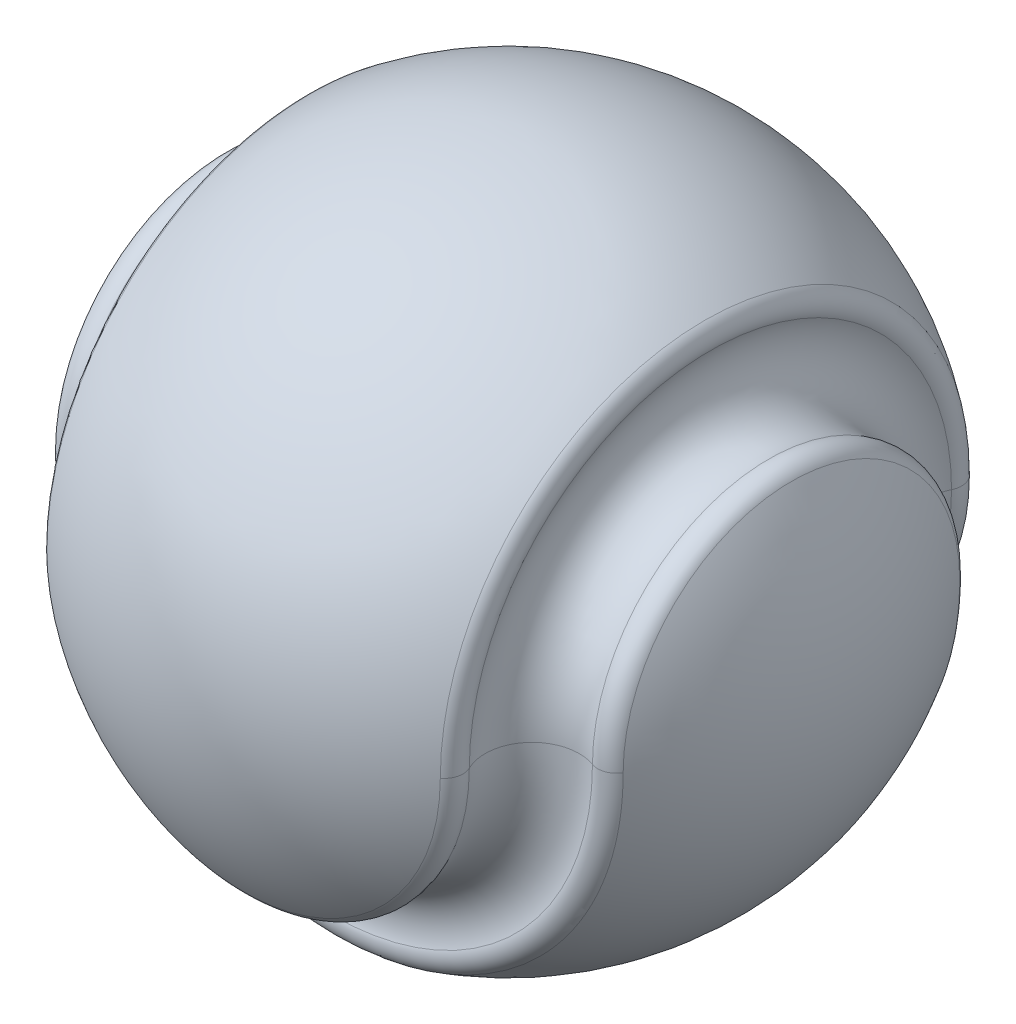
ISO-10303-21;
HEADER;
FILE_DESCRIPTION(('STEP AP214'),'2;1');
FILE_NAME('part.step','',(''),(''),'','','');
FILE_SCHEMA(('AUTOMOTIVE_DESIGN { 1 0 10303 214 1 1 1 1 }'));
ENDSEC;
DATA;
#1=APPLICATION_CONTEXT('core data for automotive mechanical design processes');
#2=APPLICATION_PROTOCOL_DEFINITION('international standard','automotive_design',2000,#1);
#3=PRODUCT_CONTEXT('',#1,'mechanical');
#4=PRODUCT('Part','Part','',(#3));
#5=PRODUCT_RELATED_PRODUCT_CATEGORY('part','',(#4));
#6=PRODUCT_DEFINITION_FORMATION('','',#4);
#7=PRODUCT_DEFINITION_CONTEXT('part definition',#1,'design');
#8=PRODUCT_DEFINITION('design','',#6,#7);
#9=PRODUCT_DEFINITION_SHAPE('','',#8);
#10=(LENGTH_UNIT() NAMED_UNIT(*) SI_UNIT(.MILLI.,.METRE.));
#11=(NAMED_UNIT(*) PLANE_ANGLE_UNIT() SI_UNIT($,.RADIAN.));
#12=(NAMED_UNIT(*) SI_UNIT($,.STERADIAN.) SOLID_ANGLE_UNIT());
#13=UNCERTAINTY_MEASURE_WITH_UNIT(LENGTH_MEASURE(1.E-05),#10,'distance_accuracy_value','');
#14=(GEOMETRIC_REPRESENTATION_CONTEXT(3) GLOBAL_UNCERTAINTY_ASSIGNED_CONTEXT((#13)) GLOBAL_UNIT_ASSIGNED_CONTEXT((#10,
#11,#12)) REPRESENTATION_CONTEXT('',''));
#15=CARTESIAN_POINT('',(0.,0.,0.));
#16=DIRECTION('',(0.,0.,1.));
#17=DIRECTION('',(1.,0.,0.));
#18=AXIS2_PLACEMENT_3D('',#15,#16,#17);
#19=CARTESIAN_POINT('',(0.,0.,0.));
#20=DIRECTION('',(1.,0.,0.));
#21=DIRECTION('',(0.,0.,1.));
#22=AXIS2_PLACEMENT_3D('',#19,#20,#21);
#23=SPHERICAL_SURFACE('',#22,35.);
#24=CARTESIAN_POINT('',(20.8911951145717,0.,0.));
#25=DIRECTION('',(-1.,0.,0.));
#26=DIRECTION('',(0.,0.,1.));
#27=AXIS2_PLACEMENT_3D('',#24,#25,#26);
#28=CIRCLE('',#27,28.0812743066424);
#29=CARTESIAN_POINT('',(20.8911951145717,0.,28.0812743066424));
#30=VERTEX_POINT('',#29);
#31=CARTESIAN_POINT('',(20.8911951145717,0.,-28.0812743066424));
#32=VERTEX_POINT('',#31);
#33=EDGE_CURVE('E187',#30,#32,#28,.T.);
#34=ORIENTED_EDGE('',*,*,#33,.T.);
#35=CARTESIAN_POINT('',(0.,0.,-28.0812743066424));
#36=DIRECTION('',(0.,0.,1.));
#37=DIRECTION('',(1.,0.,0.));
#38=AXIS2_PLACEMENT_3D('',#35,#36,#37);
#39=CIRCLE('',#38,20.8911951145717);
#40=CARTESIAN_POINT('',(-20.8911951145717,0.,-28.0812743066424));
#41=VERTEX_POINT('',#40);
#42=EDGE_CURVE('E189',#32,#41,#39,.F.);
#43=ORIENTED_EDGE('',*,*,#42,.T.);
#44=CARTESIAN_POINT('',(-20.8911951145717,0.,0.));
#45=DIRECTION('',(1.,0.,0.));
#46=DIRECTION('',(0.,0.,-1.));
#47=AXIS2_PLACEMENT_3D('',#44,#45,#46);
#48=CIRCLE('',#47,28.0812743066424);
#49=CARTESIAN_POINT('',(-20.8911951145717,0.,28.0812743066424));
#50=VERTEX_POINT('',#49);
#51=EDGE_CURVE('E183',#41,#50,#48,.T.);
#52=ORIENTED_EDGE('',*,*,#51,.T.);
#53=CARTESIAN_POINT('',(0.,0.,28.0812743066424));
#54=DIRECTION('',(0.,0.,-1.));
#55=DIRECTION('',(-1.,0.,0.));
#56=AXIS2_PLACEMENT_3D('',#53,#54,#55);
#57=CIRCLE('',#56,20.8911951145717);
#58=EDGE_CURVE('E185',#50,#30,#57,.F.);
#59=ORIENTED_EDGE('',*,*,#58,.T.);
#60=EDGE_LOOP('',(#34,#43,#52,#59));
#61=FACE_BOUND('',#60,.T.);
#62=ADVANCED_FACE('F38',(#61),#23,.T.);
#63=CARTESIAN_POINT('',(0.,0.,0.));
#64=DIRECTION('',(1.,0.,0.));
#65=DIRECTION('',(0.,0.,1.));
#66=AXIS2_PLACEMENT_3D('',#63,#64,#65);
#67=SPHERICAL_SURFACE('',#66,35.);
#68=CARTESIAN_POINT('',(30.0958178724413,0.,0.));
#69=DIRECTION('',(-1.,0.,0.));
#70=DIRECTION('',(0.,0.,1.));
#71=AXIS2_PLACEMENT_3D('',#68,#69,#70);
#72=CIRCLE('',#71,17.8673374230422);
#73=CARTESIAN_POINT('',(30.0958178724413,0.,-17.8673374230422));
#74=VERTEX_POINT('',#73);
#75=CARTESIAN_POINT('',(30.0958178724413,0.,17.8673374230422));
#76=VERTEX_POINT('',#75);
#77=EDGE_CURVE('E56',#74,#76,#72,.F.);
#78=ORIENTED_EDGE('',*,*,#77,.T.);
#79=CARTESIAN_POINT('',(0.,0.,17.8673374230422));
#80=DIRECTION('',(0.,0.,-1.));
#81=DIRECTION('',(-1.,0.,0.));
#82=AXIS2_PLACEMENT_3D('',#79,#80,#81);
#83=CIRCLE('',#82,30.0958178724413);
#84=CARTESIAN_POINT('',(-30.0958178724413,0.,17.8673374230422));
#85=VERTEX_POINT('',#84);
#86=EDGE_CURVE('E210',#76,#85,#83,.T.);
#87=ORIENTED_EDGE('',*,*,#86,.T.);
#88=CARTESIAN_POINT('',(-30.0958178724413,0.,0.));
#89=DIRECTION('',(1.,0.,0.));
#90=DIRECTION('',(0.,0.,-1.));
#91=AXIS2_PLACEMENT_3D('',#88,#89,#90);
#92=CIRCLE('',#91,17.8673374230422);
#93=CARTESIAN_POINT('',(-30.0958178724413,0.,-17.8673374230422));
#94=VERTEX_POINT('',#93);
#95=EDGE_CURVE('E206',#85,#94,#92,.F.);
#96=ORIENTED_EDGE('',*,*,#95,.T.);
#97=CARTESIAN_POINT('',(0.,0.,-17.8673374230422));
#98=DIRECTION('',(0.,0.,1.));
#99=DIRECTION('',(1.,0.,0.));
#100=AXIS2_PLACEMENT_3D('',#97,#98,#99);
#101=CIRCLE('',#100,30.0958178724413);
#102=EDGE_CURVE('E61',#94,#74,#101,.T.);
#103=ORIENTED_EDGE('',*,*,#102,.T.);
#104=EDGE_LOOP('',(#78,#87,#96,#103));
#105=FACE_BOUND('',#104,.T.);
#106=ADVANCED_FACE('F272',(#105),#67,.T.);
#107=CARTESIAN_POINT('',(26.,0.,0.));
#108=DIRECTION('',(-1.,0.,0.));
#109=DIRECTION('',(0.,0.,1.));
#110=AXIS2_PLACEMENT_3D('',#107,#108,#109);
#111=TOROIDAL_SURFACE('',#110,23.43074902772,5.);
#112=CARTESIAN_POINT('',(26.,0.,-23.43074902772));
#113=DIRECTION('',(0.,-1.,0.));
#114=DIRECTION('',(-1.,0.,0.));
#115=AXIS2_PLACEMENT_3D('',#112,#113,#114);
#116=CIRCLE('',#115,5.);
#117=CARTESIAN_POINT('',(27.6971834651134,0.,-18.7276045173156));
#118=VERTEX_POINT('',#117);
#119=CARTESIAN_POINT('',(21.4981518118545,0.,-25.6063783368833));
#120=VERTEX_POINT('',#119);
#121=EDGE_CURVE('E160',#118,#120,#116,.T.);
#122=ORIENTED_EDGE('',*,*,#121,.T.);
#123=CARTESIAN_POINT('',(21.4981518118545,0.,0.));
#124=DIRECTION('',(1.,0.,0.));
#125=DIRECTION('',(0.,0.,-1.));
#126=AXIS2_PLACEMENT_3D('',#123,#124,#125);
#127=CIRCLE('',#126,25.6063783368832);
#128=CARTESIAN_POINT('',(21.4981518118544,0.,25.6063783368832));
#129=VERTEX_POINT('',#128);
#130=EDGE_CURVE('E199',#120,#129,#127,.T.);
#131=ORIENTED_EDGE('',*,*,#130,.T.);
#132=CARTESIAN_POINT('',(26.,0.,23.43074902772));
#133=DIRECTION('',(0.,1.,0.));
#134=DIRECTION('',(-1.,0.,0.));
#135=AXIS2_PLACEMENT_3D('',#132,#133,#134);
#136=CIRCLE('',#135,5.);
#137=CARTESIAN_POINT('',(27.6971834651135,0.,18.7276045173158));
#138=VERTEX_POINT('',#137);
#139=EDGE_CURVE('E179',#138,#129,#136,.T.);
#140=ORIENTED_EDGE('',*,*,#139,.F.);
#141=CARTESIAN_POINT('',(27.6971834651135,0.,0.));
#142=DIRECTION('',(-1.,0.,0.));
#143=DIRECTION('',(0.,0.,1.));
#144=AXIS2_PLACEMENT_3D('',#141,#142,#143);
#145=CIRCLE('',#144,18.7276045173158);
#146=EDGE_CURVE('E197',#138,#118,#145,.T.);
#147=ORIENTED_EDGE('',*,*,#146,.T.);
#148=EDGE_LOOP('',(#122,#131,#140,#147));
#149=FACE_BOUND('',#148,.T.);
#150=ADVANCED_FACE('F257',(#149),#111,.F.);
#151=CARTESIAN_POINT('',(0.,0.,23.43074902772));
#152=DIRECTION('',(0.,0.,1.));
#153=DIRECTION('',(1.,0.,0.));
#154=AXIS2_PLACEMENT_3D('',#151,#152,#153);
#155=TOROIDAL_SURFACE('',#154,26.,5.);
#156=ORIENTED_EDGE('',*,*,#139,.T.);
#157=CARTESIAN_POINT('',(0.,0.,25.6063783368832));
#158=DIRECTION('',(0.,0.,-1.));
#159=DIRECTION('',(-1.,0.,0.));
#160=AXIS2_PLACEMENT_3D('',#157,#158,#159);
#161=CIRCLE('',#160,21.4981518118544);
#162=CARTESIAN_POINT('',(-21.4981518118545,0.,25.6063783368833));
#163=VERTEX_POINT('',#162);
#164=EDGE_CURVE('E204',#129,#163,#161,.T.);
#165=ORIENTED_EDGE('',*,*,#164,.T.);
#166=CARTESIAN_POINT('',(-26.,0.,23.43074902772));
#167=DIRECTION('',(0.,-1.,0.));
#168=DIRECTION('',(1.,0.,0.));
#169=AXIS2_PLACEMENT_3D('',#166,#167,#168);
#170=CIRCLE('',#169,5.);
#171=CARTESIAN_POINT('',(-27.6971834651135,0.,18.7276045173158));
#172=VERTEX_POINT('',#171);
#173=EDGE_CURVE('E176',#172,#163,#170,.T.);
#174=ORIENTED_EDGE('',*,*,#173,.F.);
#175=CARTESIAN_POINT('',(0.,0.,18.7276045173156));
#176=DIRECTION('',(0.,0.,1.));
#177=DIRECTION('',(1.,0.,0.));
#178=AXIS2_PLACEMENT_3D('',#175,#176,#177);
#179=CIRCLE('',#178,27.6971834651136);
#180=EDGE_CURVE('E201',#172,#138,#179,.T.);
#181=ORIENTED_EDGE('',*,*,#180,.T.);
#182=EDGE_LOOP('',(#156,#165,#174,#181));
#183=FACE_BOUND('',#182,.T.);
#184=ADVANCED_FACE('F261',(#183),#155,.F.);
#185=CARTESIAN_POINT('',(-26.,0.,0.));
#186=DIRECTION('',(1.,0.,0.));
#187=DIRECTION('',(0.,0.,-1.));
#188=AXIS2_PLACEMENT_3D('',#185,#186,#187);
#189=TOROIDAL_SURFACE('',#188,23.43074902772,5.);
#190=ORIENTED_EDGE('',*,*,#173,.T.);
#191=CARTESIAN_POINT('',(-21.4981518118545,0.,0.));
#192=DIRECTION('',(-1.,0.,0.));
#193=DIRECTION('',(0.,0.,1.));
#194=AXIS2_PLACEMENT_3D('',#191,#192,#193);
#195=CIRCLE('',#194,25.6063783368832);
#196=CARTESIAN_POINT('',(-21.4981518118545,0.,-25.6063783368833));
#197=VERTEX_POINT('',#196);
#198=EDGE_CURVE('E11',#163,#197,#195,.T.);
#199=ORIENTED_EDGE('',*,*,#198,.T.);
#200=CARTESIAN_POINT('',(-26.,0.,-23.43074902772));
#201=DIRECTION('',(0.,1.,0.));
#202=DIRECTION('',(1.,0.,0.));
#203=AXIS2_PLACEMENT_3D('',#200,#201,#202);
#204=CIRCLE('',#203,5.);
#205=CARTESIAN_POINT('',(-27.6971834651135,0.,-18.7276045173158));
#206=VERTEX_POINT('',#205);
#207=EDGE_CURVE('E155',#206,#197,#204,.T.);
#208=ORIENTED_EDGE('',*,*,#207,.F.);
#209=CARTESIAN_POINT('',(-27.6971834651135,0.,0.));
#210=DIRECTION('',(1.,0.,0.));
#211=DIRECTION('',(0.,0.,-1.));
#212=AXIS2_PLACEMENT_3D('',#209,#210,#211);
#213=CIRCLE('',#212,18.7276045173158);
#214=EDGE_CURVE('E48',#206,#172,#213,.T.);
#215=ORIENTED_EDGE('',*,*,#214,.T.);
#216=EDGE_LOOP('',(#190,#199,#208,#215));
#217=FACE_BOUND('',#216,.T.);
#218=ADVANCED_FACE('F243',(#217),#189,.F.);
#219=CARTESIAN_POINT('',(0.,0.,-23.43074902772));
#220=DIRECTION('',(0.,0.,-1.));
#221=DIRECTION('',(1.,0.,0.));
#222=AXIS2_PLACEMENT_3D('',#219,#220,#221);
#223=TOROIDAL_SURFACE('',#222,26.,5.);
#224=ORIENTED_EDGE('',*,*,#207,.T.);
#225=CARTESIAN_POINT('',(0.,0.,-25.6063783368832));
#226=DIRECTION('',(0.,0.,1.));
#227=DIRECTION('',(1.,0.,0.));
#228=AXIS2_PLACEMENT_3D('',#225,#226,#227);
#229=CIRCLE('',#228,21.4981518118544);
#230=EDGE_CURVE('E194',#197,#120,#229,.T.);
#231=ORIENTED_EDGE('',*,*,#230,.T.);
#232=ORIENTED_EDGE('',*,*,#121,.F.);
#233=CARTESIAN_POINT('',(0.,0.,-18.7276045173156));
#234=DIRECTION('',(0.,0.,-1.));
#235=DIRECTION('',(-1.,0.,0.));
#236=AXIS2_PLACEMENT_3D('',#233,#234,#235);
#237=CIRCLE('',#236,27.6971834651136);
#238=EDGE_CURVE('E192',#118,#206,#237,.T.);
#239=ORIENTED_EDGE('',*,*,#238,.T.);
#240=EDGE_LOOP('',(#224,#231,#232,#239));
#241=FACE_BOUND('',#240,.T.);
#242=ADVANCED_FACE('F240',(#241),#223,.F.);
#243=CARTESIAN_POINT('',(0.,0.,26.4766300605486));
#244=DIRECTION('',(0.,0.,1.));
#245=DIRECTION('',(1.,0.,0.));
#246=AXIS2_PLACEMENT_3D('',#243,#244,#245);
#247=TOROIDAL_SURFACE('',#246,19.6974125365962,2.);
#248=CARTESIAN_POINT('',(-19.6974125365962,0.,26.4766300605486));
#249=DIRECTION('',(0.,1.,0.));
#250=DIRECTION('',(-1.,0.,0.));
#251=AXIS2_PLACEMENT_3D('',#248,#249,#250);
#252=CIRCLE('',#251,2.);
#253=EDGE_CURVE('E217',#163,#50,#252,.T.);
#254=ORIENTED_EDGE('',*,*,#253,.F.);
#255=ORIENTED_EDGE('',*,*,#164,.F.);
#256=CARTESIAN_POINT('',(19.6974125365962,0.,26.4766300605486));
#257=DIRECTION('',(0.,1.,0.));
#258=DIRECTION('',(0.,0.,1.));
#259=AXIS2_PLACEMENT_3D('',#256,#257,#258);
#260=CIRCLE('',#259,2.);
#261=EDGE_CURVE('E182',#30,#129,#260,.T.);
#262=ORIENTED_EDGE('',*,*,#261,.F.);
#263=ORIENTED_EDGE('',*,*,#58,.F.);
#264=EDGE_LOOP('',(#254,#255,#262,#263));
#265=FACE_BOUND('',#264,.T.);
#266=ADVANCED_FACE('F265',(#265),#247,.T.);
#267=CARTESIAN_POINT('',(19.6974125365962,0.,0.));
#268=DIRECTION('',(-1.,0.,0.));
#269=DIRECTION('',(0.,0.,1.));
#270=AXIS2_PLACEMENT_3D('',#267,#268,#269);
#271=TOROIDAL_SURFACE('',#270,26.4766300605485,2.);
#272=ORIENTED_EDGE('',*,*,#261,.T.);
#273=ORIENTED_EDGE('',*,*,#130,.F.);
#274=CARTESIAN_POINT('',(19.6974125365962,0.,-26.4766300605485));
#275=DIRECTION('',(0.,-1.,0.));
#276=DIRECTION('',(1.,0.,0.));
#277=AXIS2_PLACEMENT_3D('',#274,#275,#276);
#278=CIRCLE('',#277,2.);
#279=EDGE_CURVE('E215',#32,#120,#278,.T.);
#280=ORIENTED_EDGE('',*,*,#279,.F.);
#281=ORIENTED_EDGE('',*,*,#33,.F.);
#282=EDGE_LOOP('',(#272,#273,#280,#281));
#283=FACE_BOUND('',#282,.T.);
#284=ADVANCED_FACE('F269',(#283),#271,.T.);
#285=CARTESIAN_POINT('',(-19.6974125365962,0.,0.));
#286=DIRECTION('',(1.,0.,0.));
#287=DIRECTION('',(0.,0.,-1.));
#288=AXIS2_PLACEMENT_3D('',#285,#286,#287);
#289=TOROIDAL_SURFACE('',#288,26.4766300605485,2.);
#290=ORIENTED_EDGE('',*,*,#253,.T.);
#291=ORIENTED_EDGE('',*,*,#51,.F.);
#292=CARTESIAN_POINT('',(-19.6974125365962,0.,-26.4766300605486));
#293=DIRECTION('',(0.,-1.,0.));
#294=DIRECTION('',(1.,0.,0.));
#295=AXIS2_PLACEMENT_3D('',#292,#293,#294);
#296=CIRCLE('',#295,2.);
#297=EDGE_CURVE('E213',#197,#41,#296,.T.);
#298=ORIENTED_EDGE('',*,*,#297,.F.);
#299=ORIENTED_EDGE('',*,*,#198,.F.);
#300=EDGE_LOOP('',(#290,#291,#298,#299));
#301=FACE_BOUND('',#300,.T.);
#302=ADVANCED_FACE('F249',(#301),#289,.T.);
#303=CARTESIAN_POINT('',(0.,0.,-26.4766300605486));
#304=DIRECTION('',(0.,0.,-1.));
#305=DIRECTION('',(-1.,0.,0.));
#306=AXIS2_PLACEMENT_3D('',#303,#304,#305);
#307=TOROIDAL_SURFACE('',#306,19.6974125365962,2.);
#308=ORIENTED_EDGE('',*,*,#279,.T.);
#309=ORIENTED_EDGE('',*,*,#230,.F.);
#310=ORIENTED_EDGE('',*,*,#297,.T.);
#311=ORIENTED_EDGE('',*,*,#42,.F.);
#312=EDGE_LOOP('',(#308,#309,#310,#311));
#313=FACE_BOUND('',#312,.T.);
#314=ADVANCED_FACE('F253',(#313),#307,.T.);
#315=CARTESIAN_POINT('',(0.,0.,-16.846346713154));
#316=DIRECTION('',(0.,0.,1.));
#317=DIRECTION('',(1.,0.,0.));
#318=AXIS2_PLACEMENT_3D('',#315,#316,#317);
#319=TOROIDAL_SURFACE('',#318,28.3760568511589,2.);
#320=CARTESIAN_POINT('',(-28.3760568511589,0.,-16.8463467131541));
#321=DIRECTION('',(0.,1.,0.));
#322=DIRECTION('',(-1.,0.,0.));
#323=AXIS2_PLACEMENT_3D('',#320,#321,#322);
#324=CIRCLE('',#323,2.);
#325=EDGE_CURVE('E225',#206,#94,#324,.T.);
#326=ORIENTED_EDGE('',*,*,#325,.F.);
#327=ORIENTED_EDGE('',*,*,#238,.F.);
#328=CARTESIAN_POINT('',(28.3760568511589,0.,-16.846346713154));
#329=DIRECTION('',(0.,1.,0.));
#330=DIRECTION('',(0.,0.,1.));
#331=AXIS2_PLACEMENT_3D('',#328,#329,#330);
#332=CIRCLE('',#331,2.);
#333=EDGE_CURVE('E42',#74,#118,#332,.T.);
#334=ORIENTED_EDGE('',*,*,#333,.F.);
#335=ORIENTED_EDGE('',*,*,#102,.F.);
#336=EDGE_LOOP('',(#326,#327,#334,#335));
#337=FACE_BOUND('',#336,.T.);
#338=ADVANCED_FACE('F40',(#337),#319,.T.);
#339=CARTESIAN_POINT('',(28.3760568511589,0.,0.));
#340=DIRECTION('',(1.,0.,0.));
#341=DIRECTION('',(0.,0.,-1.));
#342=AXIS2_PLACEMENT_3D('',#339,#340,#341);
#343=TOROIDAL_SURFACE('',#342,16.8463467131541,2.);
#344=ORIENTED_EDGE('',*,*,#333,.T.);
#345=ORIENTED_EDGE('',*,*,#146,.F.);
#346=CARTESIAN_POINT('',(28.3760568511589,0.,16.8463467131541));
#347=DIRECTION('',(0.,-1.,0.));
#348=DIRECTION('',(1.,0.,0.));
#349=AXIS2_PLACEMENT_3D('',#346,#347,#348);
#350=CIRCLE('',#349,2.);
#351=EDGE_CURVE('E224',#76,#138,#350,.T.);
#352=ORIENTED_EDGE('',*,*,#351,.F.);
#353=ORIENTED_EDGE('',*,*,#77,.F.);
#354=EDGE_LOOP('',(#344,#345,#352,#353));
#355=FACE_BOUND('',#354,.T.);
#356=ADVANCED_FACE('F234',(#355),#343,.T.);
#357=CARTESIAN_POINT('',(-28.3760568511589,0.,0.));
#358=DIRECTION('',(-1.,0.,0.));
#359=DIRECTION('',(0.,0.,1.));
#360=AXIS2_PLACEMENT_3D('',#357,#358,#359);
#361=TOROIDAL_SURFACE('',#360,16.8463467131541,2.);
#362=ORIENTED_EDGE('',*,*,#325,.T.);
#363=ORIENTED_EDGE('',*,*,#95,.F.);
#364=CARTESIAN_POINT('',(-28.3760568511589,0.,16.8463467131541));
#365=DIRECTION('',(0.,-1.,0.));
#366=DIRECTION('',(0.,0.,-1.));
#367=AXIS2_PLACEMENT_3D('',#364,#365,#366);
#368=CIRCLE('',#367,2.);
#369=EDGE_CURVE('E222',#172,#85,#368,.T.);
#370=ORIENTED_EDGE('',*,*,#369,.F.);
#371=ORIENTED_EDGE('',*,*,#214,.F.);
#372=EDGE_LOOP('',(#362,#363,#370,#371));
#373=FACE_BOUND('',#372,.T.);
#374=ADVANCED_FACE('F291',(#373),#361,.T.);
#375=CARTESIAN_POINT('',(0.,0.,16.846346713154));
#376=DIRECTION('',(0.,0.,-1.));
#377=DIRECTION('',(-1.,0.,0.));
#378=AXIS2_PLACEMENT_3D('',#375,#376,#377);
#379=TOROIDAL_SURFACE('',#378,28.3760568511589,2.);
#380=ORIENTED_EDGE('',*,*,#351,.T.);
#381=ORIENTED_EDGE('',*,*,#180,.F.);
#382=ORIENTED_EDGE('',*,*,#369,.T.);
#383=ORIENTED_EDGE('',*,*,#86,.F.);
#384=EDGE_LOOP('',(#380,#381,#382,#383));
#385=FACE_BOUND('',#384,.T.);
#386=ADVANCED_FACE('F288',(#385),#379,.T.);
#387=CLOSED_SHELL('',(#62,#106,#150,#184,#218,#242,#266,#284,#302,#314,#338,#356,#374,#386));
#388=CARTESIAN_POINT('',(0.,0.,0.));
#389=DIRECTION('',(1.,0.,0.));
#390=DIRECTION('',(0.,0.,1.));
#391=AXIS2_PLACEMENT_3D('',#388,#389,#390);
#392=SPHERICAL_SURFACE('',#391,33.);
#393=CARTESIAN_POINT('',(19.6974125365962,0.,0.));
#394=DIRECTION('',(-1.,0.,0.));
#395=DIRECTION('',(0.,0.,1.));
#396=AXIS2_PLACEMENT_3D('',#393,#394,#395);
#397=CIRCLE('',#396,26.4766300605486);
#398=CARTESIAN_POINT('',(19.6974125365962,0.,26.4766300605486));
#399=VERTEX_POINT('',#398);
#400=CARTESIAN_POINT('',(19.6974125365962,0.,-26.4766300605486));
#401=VERTEX_POINT('',#400);
#402=EDGE_CURVE('E128',#399,#401,#397,.T.);
#403=ORIENTED_EDGE('',*,*,#402,.F.);
#404=CARTESIAN_POINT('',(0.,0.,26.4766300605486));
#405=DIRECTION('',(0.,0.,1.));
#406=DIRECTION('',(1.,0.,0.));
#407=AXIS2_PLACEMENT_3D('',#404,#405,#406);
#408=CIRCLE('',#407,19.6974125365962);
#409=CARTESIAN_POINT('',(-19.6974125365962,0.,26.4766300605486));
#410=VERTEX_POINT('',#409);
#411=EDGE_CURVE('E131',#410,#399,#408,.T.);
#412=ORIENTED_EDGE('',*,*,#411,.F.);
#413=CARTESIAN_POINT('',(-19.6974125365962,0.,0.));
#414=DIRECTION('',(1.,0.,0.));
#415=DIRECTION('',(0.,0.,-1.));
#416=AXIS2_PLACEMENT_3D('',#413,#414,#415);
#417=CIRCLE('',#416,26.4766300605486);
#418=CARTESIAN_POINT('',(-19.6974125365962,0.,-26.4766300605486));
#419=VERTEX_POINT('',#418);
#420=EDGE_CURVE('E150',#419,#410,#417,.T.);
#421=ORIENTED_EDGE('',*,*,#420,.F.);
#422=CARTESIAN_POINT('',(0.,0.,-26.4766300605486));
#423=DIRECTION('',(0.,0.,-1.));
#424=DIRECTION('',(-1.,0.,0.));
#425=AXIS2_PLACEMENT_3D('',#422,#423,#424);
#426=CIRCLE('',#425,19.6974125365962);
#427=EDGE_CURVE('E134',#401,#419,#426,.T.);
#428=ORIENTED_EDGE('',*,*,#427,.F.);
#429=EDGE_LOOP('',(#403,#412,#421,#428));
#430=FACE_BOUND('',#429,.T.);
#431=ADVANCED_FACE('F130',(#430),#392,.F.);
#432=CARTESIAN_POINT('',(0.,0.,0.));
#433=DIRECTION('',(1.,0.,0.));
#434=DIRECTION('',(0.,0.,1.));
#435=AXIS2_PLACEMENT_3D('',#432,#433,#434);
#436=SPHERICAL_SURFACE('',#435,33.);
#437=CARTESIAN_POINT('',(28.3760568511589,0.,0.));
#438=DIRECTION('',(-1.,0.,0.));
#439=DIRECTION('',(0.,0.,1.));
#440=AXIS2_PLACEMENT_3D('',#437,#438,#439);
#441=CIRCLE('',#440,16.8463467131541);
#442=CARTESIAN_POINT('',(28.3760568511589,0.,-16.8463467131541));
#443=VERTEX_POINT('',#442);
#444=CARTESIAN_POINT('',(28.3760568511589,0.,16.8463467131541));
#445=VERTEX_POINT('',#444);
#446=EDGE_CURVE('E139',#443,#445,#441,.F.);
#447=ORIENTED_EDGE('',*,*,#446,.F.);
#448=CARTESIAN_POINT('',(0.,0.,-16.8463467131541));
#449=DIRECTION('',(0.,0.,-1.));
#450=DIRECTION('',(-1.,0.,0.));
#451=AXIS2_PLACEMENT_3D('',#448,#449,#450);
#452=CIRCLE('',#451,28.3760568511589);
#453=CARTESIAN_POINT('',(-28.3760568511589,0.,-16.8463467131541));
#454=VERTEX_POINT('',#453);
#455=EDGE_CURVE('E165',#454,#443,#452,.F.);
#456=ORIENTED_EDGE('',*,*,#455,.F.);
#457=CARTESIAN_POINT('',(-28.3760568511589,0.,0.));
#458=DIRECTION('',(1.,0.,0.));
#459=DIRECTION('',(0.,0.,-1.));
#460=AXIS2_PLACEMENT_3D('',#457,#458,#459);
#461=CIRCLE('',#460,16.8463467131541);
#462=CARTESIAN_POINT('',(-28.3760568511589,0.,16.8463467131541));
#463=VERTEX_POINT('',#462);
#464=EDGE_CURVE('E168',#463,#454,#461,.F.);
#465=ORIENTED_EDGE('',*,*,#464,.F.);
#466=CARTESIAN_POINT('',(0.,0.,16.8463467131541));
#467=DIRECTION('',(0.,0.,1.));
#468=DIRECTION('',(1.,0.,0.));
#469=AXIS2_PLACEMENT_3D('',#466,#467,#468);
#470=CIRCLE('',#469,28.3760568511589);
#471=EDGE_CURVE('E151',#445,#463,#470,.F.);
#472=ORIENTED_EDGE('',*,*,#471,.F.);
#473=EDGE_LOOP('',(#447,#456,#465,#472));
#474=FACE_BOUND('',#473,.T.);
#475=ADVANCED_FACE('F391',(#474),#436,.F.);
#476=CARTESIAN_POINT('',(26.,0.,0.));
#477=DIRECTION('',(-1.,0.,0.));
#478=DIRECTION('',(0.,0.,1.));
#479=AXIS2_PLACEMENT_3D('',#476,#477,#478);
#480=TOROIDAL_SURFACE('',#479,23.43074902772,7.);
#481=ORIENTED_EDGE('',*,*,#402,.T.);
#482=CARTESIAN_POINT('',(26.,0.,-23.43074902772));
#483=DIRECTION('',(0.,1.,0.));
#484=DIRECTION('',(0.,0.,1.));
#485=AXIS2_PLACEMENT_3D('',#482,#483,#484);
#486=CIRCLE('',#485,7.);
#487=EDGE_CURVE('E157',#443,#401,#486,.F.);
#488=ORIENTED_EDGE('',*,*,#487,.F.);
#489=ORIENTED_EDGE('',*,*,#446,.T.);
#490=CARTESIAN_POINT('',(26.,0.,23.43074902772));
#491=DIRECTION('',(0.,-1.,0.));
#492=DIRECTION('',(0.,0.,-1.));
#493=AXIS2_PLACEMENT_3D('',#490,#491,#492);
#494=CIRCLE('',#493,7.);
#495=EDGE_CURVE('E147',#445,#399,#494,.F.);
#496=ORIENTED_EDGE('',*,*,#495,.T.);
#497=EDGE_LOOP('',(#481,#488,#489,#496));
#498=FACE_BOUND('',#497,.T.);
#499=ADVANCED_FACE('F154',(#498),#480,.T.);
#500=CARTESIAN_POINT('',(0.,0.,23.43074902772));
#501=DIRECTION('',(0.,0.,1.));
#502=DIRECTION('',(1.,0.,0.));
#503=AXIS2_PLACEMENT_3D('',#500,#501,#502);
#504=TOROIDAL_SURFACE('',#503,26.,7.);
#505=CARTESIAN_POINT('',(-26.,0.,23.43074902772));
#506=DIRECTION('',(0.,1.,0.));
#507=DIRECTION('',(-1.,0.,0.));
#508=AXIS2_PLACEMENT_3D('',#505,#506,#507);
#509=CIRCLE('',#508,7.);
#510=EDGE_CURVE('E149',#463,#410,#509,.F.);
#511=ORIENTED_EDGE('',*,*,#510,.T.);
#512=ORIENTED_EDGE('',*,*,#411,.T.);
#513=ORIENTED_EDGE('',*,*,#495,.F.);
#514=ORIENTED_EDGE('',*,*,#471,.T.);
#515=EDGE_LOOP('',(#511,#512,#513,#514));
#516=FACE_BOUND('',#515,.T.);
#517=ADVANCED_FACE('F145',(#516),#504,.T.);
#518=CARTESIAN_POINT('',(-26.,0.,0.));
#519=DIRECTION('',(1.,0.,0.));
#520=DIRECTION('',(0.,0.,-1.));
#521=AXIS2_PLACEMENT_3D('',#518,#519,#520);
#522=TOROIDAL_SURFACE('',#521,23.43074902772,7.);
#523=ORIENTED_EDGE('',*,*,#510,.F.);
#524=ORIENTED_EDGE('',*,*,#464,.T.);
#525=CARTESIAN_POINT('',(-26.,0.,-23.43074902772));
#526=DIRECTION('',(0.,-1.,0.));
#527=DIRECTION('',(0.,0.,-1.));
#528=AXIS2_PLACEMENT_3D('',#525,#526,#527);
#529=CIRCLE('',#528,7.);
#530=EDGE_CURVE('E140',#454,#419,#529,.F.);
#531=ORIENTED_EDGE('',*,*,#530,.T.);
#532=ORIENTED_EDGE('',*,*,#420,.T.);
#533=EDGE_LOOP('',(#523,#524,#531,#532));
#534=FACE_BOUND('',#533,.T.);
#535=ADVANCED_FACE('F360',(#534),#522,.T.);
#536=CARTESIAN_POINT('',(0.,0.,-23.43074902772));
#537=DIRECTION('',(0.,0.,-1.));
#538=DIRECTION('',(1.,0.,0.));
#539=AXIS2_PLACEMENT_3D('',#536,#537,#538);
#540=TOROIDAL_SURFACE('',#539,26.,7.);
#541=ORIENTED_EDGE('',*,*,#487,.T.);
#542=ORIENTED_EDGE('',*,*,#427,.T.);
#543=ORIENTED_EDGE('',*,*,#530,.F.);
#544=ORIENTED_EDGE('',*,*,#455,.T.);
#545=EDGE_LOOP('',(#541,#542,#543,#544));
#546=FACE_BOUND('',#545,.T.);
#547=ADVANCED_FACE('F355',(#546),#540,.T.);
#548=CLOSED_SHELL('',(#431,#475,#499,#517,#535,#547));
#549=ORIENTED_CLOSED_SHELL('',*,#548,.T.);
#550=BREP_WITH_VOIDS('B2',#387,(#549));
#551=ADVANCED_BREP_SHAPE_REPRESENTATION('',(#18,#550),#14);
#552=SHAPE_DEFINITION_REPRESENTATION(#9,#551);
ENDSEC;
END-ISO-10303-21;
